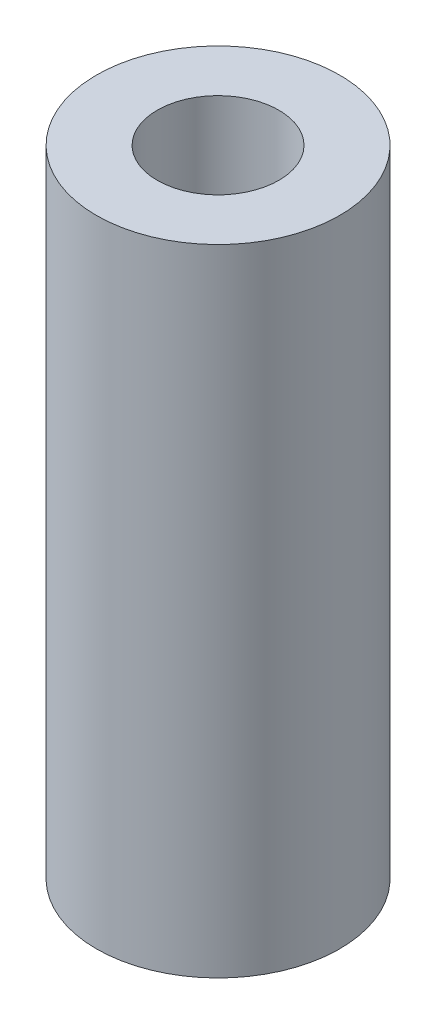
ISO-10303-21;
HEADER;
FILE_DESCRIPTION(('STEP AP214'),'2;1');
FILE_NAME('part.step','',(''),(''),'','','');
FILE_SCHEMA(('AUTOMOTIVE_DESIGN { 1 0 10303 214 1 1 1 1 }'));
ENDSEC;
DATA;
#1=APPLICATION_CONTEXT('core data for automotive mechanical design processes');
#2=APPLICATION_PROTOCOL_DEFINITION('international standard','automotive_design',2000,#1);
#3=PRODUCT_CONTEXT('',#1,'mechanical');
#4=PRODUCT('Part','Part','',(#3));
#5=PRODUCT_RELATED_PRODUCT_CATEGORY('part','',(#4));
#6=PRODUCT_DEFINITION_FORMATION('','',#4);
#7=PRODUCT_DEFINITION_CONTEXT('part definition',#1,'design');
#8=PRODUCT_DEFINITION('design','',#6,#7);
#9=PRODUCT_DEFINITION_SHAPE('','',#8);
#10=(LENGTH_UNIT() NAMED_UNIT(*) SI_UNIT(.MILLI.,.METRE.));
#11=(NAMED_UNIT(*) PLANE_ANGLE_UNIT() SI_UNIT($,.RADIAN.));
#12=(NAMED_UNIT(*) SI_UNIT($,.STERADIAN.) SOLID_ANGLE_UNIT());
#13=UNCERTAINTY_MEASURE_WITH_UNIT(LENGTH_MEASURE(1.E-05),#10,'distance_accuracy_value','');
#14=(GEOMETRIC_REPRESENTATION_CONTEXT(3) GLOBAL_UNCERTAINTY_ASSIGNED_CONTEXT((#13)) GLOBAL_UNIT_ASSIGNED_CONTEXT((#10,
#11,#12)) REPRESENTATION_CONTEXT('',''));
#15=CARTESIAN_POINT('',(0.,0.,0.));
#16=DIRECTION('',(0.,0.,1.));
#17=DIRECTION('',(1.,0.,0.));
#18=AXIS2_PLACEMENT_3D('',#15,#16,#17);
#19=CARTESIAN_POINT('',(0.,41.4528,0.));
#20=DIRECTION('',(0.,1.,0.));
#21=DIRECTION('',(0.,0.,1.));
#22=AXIS2_PLACEMENT_3D('',#19,#20,#21);
#23=PLANE('',#22);
#24=CARTESIAN_POINT('',(0.,41.4528,0.));
#25=DIRECTION('',(0.,1.,0.));
#26=DIRECTION('',(0.,0.,1.));
#27=AXIS2_PLACEMENT_3D('',#24,#25,#26);
#28=CIRCLE('',#27,15.875);
#29=CARTESIAN_POINT('',(0.,41.4528,15.875));
#30=VERTEX_POINT('',#29);
#31=EDGE_CURVE('E12',#30,#30,#28,.T.);
#32=ORIENTED_EDGE('',*,*,#31,.T.);
#33=EDGE_LOOP('',(#32));
#34=FACE_BOUND('',#33,.T.);
#35=CARTESIAN_POINT('',(0.,41.4528,0.));
#36=DIRECTION('',(0.,1.,0.));
#37=DIRECTION('',(0.,0.,1.));
#38=AXIS2_PLACEMENT_3D('',#35,#36,#37);
#39=CIRCLE('',#38,7.9375);
#40=CARTESIAN_POINT('',(0.,41.4528,7.9375));
#41=VERTEX_POINT('',#40);
#42=EDGE_CURVE('E55',#41,#41,#39,.T.);
#43=ORIENTED_EDGE('',*,*,#42,.F.);
#44=EDGE_LOOP('',(#43));
#45=FACE_BOUND('',#44,.T.);
#46=ADVANCED_FACE('F42',(#34,#45),#23,.T.);
#47=CARTESIAN_POINT('',(0.,-41.4528,0.));
#48=DIRECTION('',(0.,1.,0.));
#49=DIRECTION('',(0.,0.,1.));
#50=AXIS2_PLACEMENT_3D('',#47,#48,#49);
#51=PLANE('',#50);
#52=CARTESIAN_POINT('',(0.,-41.4528,0.));
#53=DIRECTION('',(0.,1.,0.));
#54=DIRECTION('',(0.,0.,1.));
#55=AXIS2_PLACEMENT_3D('',#52,#53,#54);
#56=CIRCLE('',#55,15.875);
#57=CARTESIAN_POINT('',(0.,-41.4528,15.875));
#58=VERTEX_POINT('',#57);
#59=EDGE_CURVE('E46',#58,#58,#56,.T.);
#60=ORIENTED_EDGE('',*,*,#59,.F.);
#61=EDGE_LOOP('',(#60));
#62=FACE_BOUND('',#61,.T.);
#63=CARTESIAN_POINT('',(0.,-41.4528,0.));
#64=DIRECTION('',(0.,1.,0.));
#65=DIRECTION('',(0.,0.,1.));
#66=AXIS2_PLACEMENT_3D('',#63,#64,#65);
#67=CIRCLE('',#66,7.9375);
#68=CARTESIAN_POINT('',(0.,-41.4528,7.9375));
#69=VERTEX_POINT('',#68);
#70=EDGE_CURVE('E57',#69,#69,#67,.T.);
#71=ORIENTED_EDGE('',*,*,#70,.T.);
#72=EDGE_LOOP('',(#71));
#73=FACE_BOUND('',#72,.T.);
#74=ADVANCED_FACE('F67',(#62,#73),#51,.F.);
#75=CARTESIAN_POINT('',(0.,41.4528,0.));
#76=DIRECTION('',(0.,-1.,0.));
#77=DIRECTION('',(0.,0.,-1.));
#78=AXIS2_PLACEMENT_3D('',#75,#76,#77);
#79=CYLINDRICAL_SURFACE('',#78,15.875);
#80=ORIENTED_EDGE('',*,*,#31,.F.);
#81=EDGE_LOOP('',(#80));
#82=FACE_BOUND('',#81,.T.);
#83=ORIENTED_EDGE('',*,*,#59,.T.);
#84=EDGE_LOOP('',(#83));
#85=FACE_BOUND('',#84,.T.);
#86=ADVANCED_FACE('F44',(#82,#85),#79,.T.);
#87=CARTESIAN_POINT('',(0.,41.4528,0.));
#88=DIRECTION('',(0.,-1.,0.));
#89=DIRECTION('',(0.,0.,-1.));
#90=AXIS2_PLACEMENT_3D('',#87,#88,#89);
#91=CYLINDRICAL_SURFACE('',#90,7.9375);
#92=ORIENTED_EDGE('',*,*,#42,.T.);
#93=EDGE_LOOP('',(#92));
#94=FACE_BOUND('',#93,.T.);
#95=ORIENTED_EDGE('',*,*,#70,.F.);
#96=EDGE_LOOP('',(#95));
#97=FACE_BOUND('',#96,.T.);
#98=ADVANCED_FACE('F63',(#94,#97),#91,.F.);
#99=CLOSED_SHELL('',(#46,#74,#86,#98));
#100=MANIFOLD_SOLID_BREP('B2',#99);
#101=ADVANCED_BREP_SHAPE_REPRESENTATION('',(#18,#100),#14);
#102=SHAPE_DEFINITION_REPRESENTATION(#9,#101);
ENDSEC;
END-ISO-10303-21;
